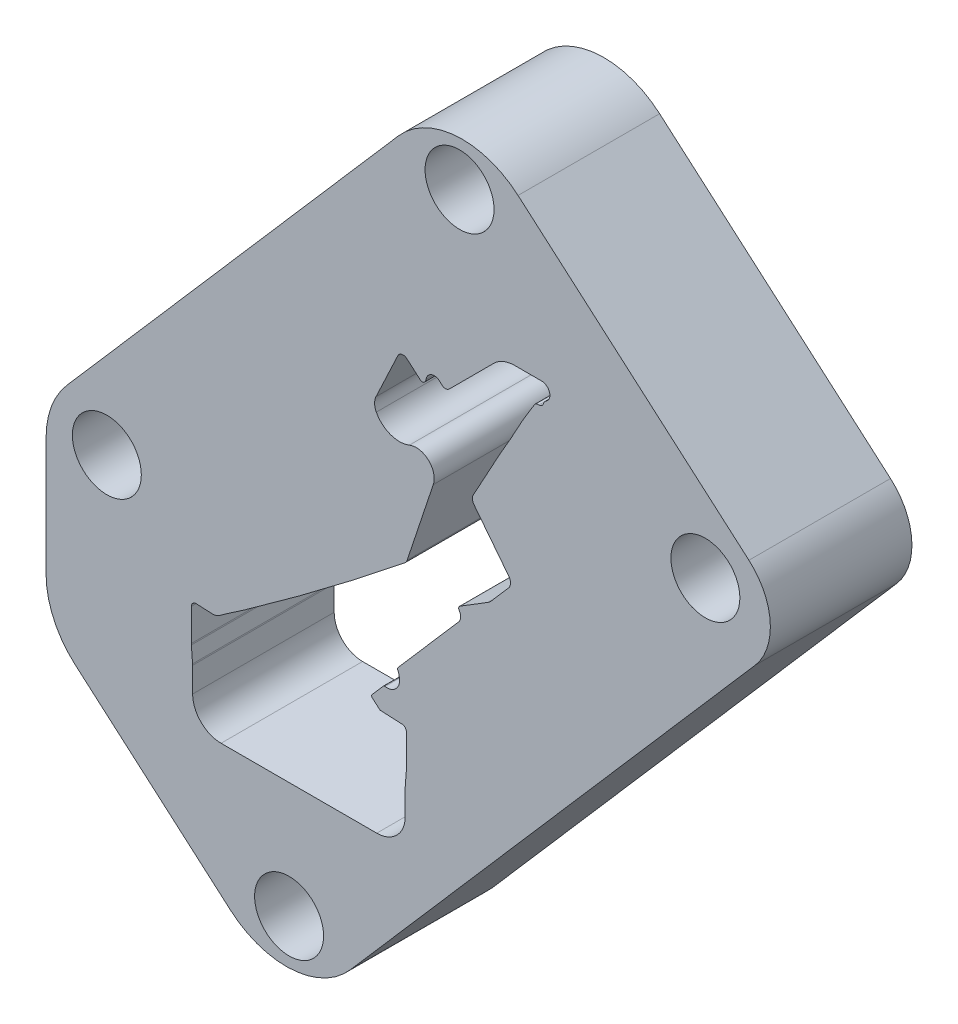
from build123d import *

# Parameters (mm, degrees)
BOSS_EXTRUDE1_DEPTH                                 = 31.75
HOLE1_D                                             = 10.3124
HOLE1_CBORE_D                                       = 15.4686
HOLE1_CBORE_DEPTH                                   = 17.526
CUT_EXTRUDE1_QU250515L_PUNCH26_MOUNTED_I_DEPTH      = 457.695359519
CUT_EXTRUDE1_QU250515L_PUNCH26_MOUNTED_I_DEPTH_BACK = 457.695359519


with BuildPart() as part:
    # Sketch1 → Boss-Extrude1 (new body)
    with BuildSketch(Plane.XY):
        with BuildLine():
            Line((-277.337723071, -5.739318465), (-329.117687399, 39.227910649))
            ThreePointArc((-329.117687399, 39.227910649), (-342.946731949, 43.847530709), (-355.991907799, 37.335484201))
            Line((-355.991907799, 37.335484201), (-430.308323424, -48.240198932))
            ThreePointArc((-430.308323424, -48.240198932), (-433.770234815, -54.06400551), (-434.975, -60.731095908))
            Line((-434.975, -60.731095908), (-434.975, -87.232348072))
            ThreePointArc((-434.975, -87.232348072), (-433.257831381, -95.13648979), (-428.415896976, -101.615671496))
            Line((-428.415896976, -101.615671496), (-393.591348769, -131.858323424))
            ThreePointArc((-393.591348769, -131.858323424), (-379.762304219, -136.477943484), (-366.717128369, -129.965896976))
            Line((-366.717128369, -129.965896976), (-275.949943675, -25.447080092))
            ThreePointArc((-275.949943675, -25.447080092), (-272.562222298, -15.305780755), (-277.337723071, -5.739318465))
        make_face()
    extrude(amount=-BOSS_EXTRUDE1_DEPTH)

    # Hole1 (through all)
    with Locations(Plane(origin=(-333.790541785, -24.126620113, 0), x_dir=(1, 0, 0), z_dir=(0, 0, 1))):
        with Locations((-8.448851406, 57.929280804), (46.687221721, 10.047509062), (-46.679101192, -102.306453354), (-87.557865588, -33.165100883)):
            CounterBoreHole(HOLE1_D / 2, HOLE1_CBORE_D / 2, HOLE1_CBORE_DEPTH)

    # Sketch1 QU250515L_Punch26_Mounted in the → Cut-Extrude1 QU250515L_Punch26_Mounted i (cut, two sides: drawn at the far end of the back side and taken through both)
    with BuildSketch(Plane.XY.offset(-4.7625).offset(-CUT_EXTRUDE1_QU250515L_PUNCH26_MOUNTED_I_DEPTH_BACK)):
        with BuildLine():
            Line((-355.168063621, -76.458871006), (-360.06403829, -76.228140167))
            Line((-360.06403829, -76.228140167), (-361.809510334, -74.712321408))
            ThreePointArc((-361.809510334, -74.712321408), (-361.960589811, -74.409673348), (-361.853414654, -74.088839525))
            Line((-361.853414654, -74.088839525), (-359.358052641, -71.215420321))
            ThreePointArc((-359.358052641, -71.215420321), (-359.175232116, -71.089799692), (-358.954407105, -71.068821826))
            ThreePointArc((-358.954407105, -71.068821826), (-356.552710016, -70.316386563), (-355.708459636, -67.945405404))
            Line((-355.708459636, -67.945405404), (-355.76551881, -67.474045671))
            ThreePointArc((-355.76551881, -67.474045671), (-355.883493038, -66.940336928), (-356.102210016, -66.439411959))
            ThreePointArc((-356.102210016, -66.439411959), (-356.155830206, -66.178623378), (-356.049913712, -65.934354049))
            Line((-356.049913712, -65.934354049), (-342.441341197, -50.264019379))
            ThreePointArc((-342.441341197, -50.264019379), (-341.992784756, -49.163111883), (-342.309268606, -48.017233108))
            ThreePointArc((-342.309268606, -48.017233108), (-342.41459973, -47.480419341), (-342.099390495, -47.033309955))
            Line((-342.099390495, -47.033309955), (-335.919084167, -43.220151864))
            ThreePointArc((-335.919084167, -43.220151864), (-335.491350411, -42.909242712), (-335.115417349, -42.537362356))
            Line((-335.115417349, -42.537362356), (-331.258982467, -38.096660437))
            ThreePointArc((-331.258982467, -38.096660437), (-330.807856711, -36.934912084), (-331.198719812, -35.751527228))
            Line((-331.198719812, -35.751527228), (-338.994064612, -25.783985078))
            ThreePointArc((-338.994064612, -25.783985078), (-339.345078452, -24.886393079), (-339.145023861, -23.943599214))
            Line((-339.145023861, -23.943599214), (-333.295726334, -13.237208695))
            Line((-333.295726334, -13.237208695), (-330.713357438, -8.740266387))
            Line((-330.713357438, -8.740266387), (-328.542354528, -4.766523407))
            ThreePointArc((-328.542354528, -4.766523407), (-328.327052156, -4.381014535), (-328.109942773, -3.996520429))
            ThreePointArc((-328.109942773, -3.996520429), (-327.886949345, -3.615246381), (-327.659514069, -3.236605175))
            ThreePointArc((-327.659514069, -3.236605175), (-326.543153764, -1.367046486), (-325.396096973, 0.483837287))
            ThreePointArc((-325.396096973, 0.483837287), (-325.28652879, 0.616600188), (-325.147132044, 0.717593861))
            ThreePointArc((-325.147132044, 0.717593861), (-324.803289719, 0.845548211), (-324.437274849, 0.870707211))
            ThreePointArc((-324.437274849, 0.870707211), (-323.900195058, 0.99842132), (-323.536149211, 1.413434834))
            ThreePointArc((-323.536149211, 1.413434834), (-323.434627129, 1.644603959), (-323.33200808, 1.875288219))
            ThreePointArc((-323.33200808, 1.875288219), (-323.136865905, 2.178825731), (-322.860539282, 2.410901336))
            ThreePointArc((-322.860539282, 2.410901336), (-322.046271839, 4.483872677), (-323.821484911, 5.828811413))
            Line((-323.821484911, 5.828811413), (-329.866864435, 5.828811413))
            ThreePointArc((-329.866864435, 5.828811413), (-332.419378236, 5.32108485), (-334.58329495, 3.875201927))
            Line((-334.58329495, 3.875201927), (-344.543862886, -6.085366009))
            ThreePointArc((-344.543862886, -6.085366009), (-345.395191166, -6.437997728), (-346.246519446, -6.085366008))
            Line((-346.246519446, -6.085366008), (-346.605729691, -5.726155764))
            ThreePointArc((-346.605729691, -5.726155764), (-348.50370992, -5.284353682), (-349.738283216, -6.792115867))
            ThreePointArc((-349.738283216, -6.792115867), (-349.833962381, -7.130148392), (-350.023149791, -7.426169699))
            Line((-350.023149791, -7.426169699), (-350.0714191, -7.481752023))
            ThreePointArc((-350.0714191, -7.481752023), (-350.548002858, -7.719658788), (-351.053223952, -7.550888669))
            Line((-351.053223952, -7.550888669), (-354.029889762, -4.965865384))
            ThreePointArc((-354.029889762, -4.965865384), (-355.167948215, -4.670932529), (-356.089841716, -5.400504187))
            Line((-356.089841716, -5.400504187), (-360.97802924, -15.78876023))
            ThreePointArc((-360.97802924, -15.78876023), (-361.292728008, -17.278380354), (-360.908651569, -18.751638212))
            ThreePointArc((-360.908651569, -18.751638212), (-357.715633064, -21.531314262), (-353.482996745, -21.449119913))
            ThreePointArc((-353.482996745, -21.449119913), (-349.207400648, -22.238140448), (-348.13687674, -26.452076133))
            Line((-348.13687674, -26.452076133), (-353.991588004, -44.061204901))
            ThreePointArc((-353.991588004, -44.061204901), (-354.205494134, -44.488868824), (-354.531224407, -44.838943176))
            ThreePointArc((-354.531224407, -44.838943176), (-372.236287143, -58.652534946), (-390.375522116, -71.890839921))
            Line((-390.375522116, -71.890839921), (-394.251596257, -74.543197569))
            ThreePointArc((-394.251596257, -74.543197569), (-395.1524968, -75.181177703), (-396.052036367, -75.821075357))
            ThreePointArc((-396.052036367, -75.821075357), (-396.86571507, -76.216899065), (-397.764107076, -76.324793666))
            Line((-397.764107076, -76.324793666), (-401.269063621, -76.159616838))
            ThreePointArc((-401.269063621, -76.159616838), (-402.066892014, -76.457537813), (-402.40204, -77.240457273))
            Line((-402.40204, -77.240457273), (-402.40204, -84.43980295))
            ThreePointArc((-402.40204, -84.43980295), (-402.39929802, -84.581894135), (-402.391076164, -84.723773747))
            Line((-402.391076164, -84.723773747), (-402.118363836, -88.250226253))
            ThreePointArc((-402.118363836, -88.250226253), (-402.11014198, -88.392105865), (-402.1074, -88.53419705))
            Line((-402.1074, -88.53419705), (-402.1074, -94.107))
            ThreePointArc((-402.1074, -94.107), (-400.240088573, -98.615088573), (-395.732, -100.4824))
            Line((-395.732, -100.4824), (-360.807, -100.4824))
            ThreePointArc((-360.807, -100.4824), (-356.298911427, -98.615088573), (-354.4316, -94.107))
            Line((-354.4316, -94.107), (-354.4316, -88.53419705))
            ThreePointArc((-354.4316, -88.53419705), (-354.42885802, -88.392105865), (-354.420636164, -88.250226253))
            Line((-354.420636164, -88.250226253), (-354.147923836, -84.723773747))
            ThreePointArc((-354.147923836, -84.723773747), (-354.13970198, -84.581894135), (-354.13696, -84.43980295))
            Line((-354.13696, -84.43980295), (-354.13696, -77.539711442))
            ThreePointArc((-354.13696, -77.539711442), (-354.43608054, -76.792819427), (-355.168063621, -76.458871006))
        make_face()
    extrude(amount=CUT_EXTRUDE1_QU250515L_PUNCH26_MOUNTED_I_DEPTH + CUT_EXTRUDE1_QU250515L_PUNCH26_MOUNTED_I_DEPTH_BACK, mode=Mode.SUBTRACT)


solid = part.part
